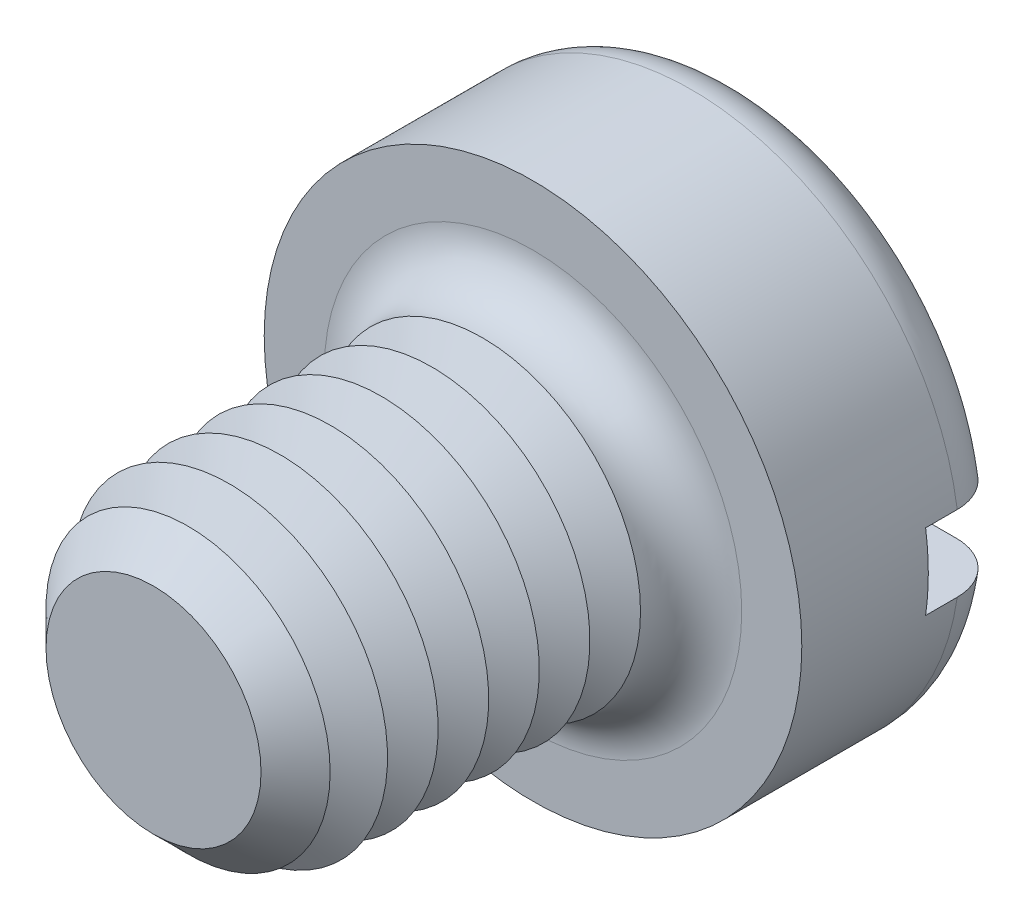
from build123d import *

# Parameters (mm, degrees)
SKETCH3_R           = 4.25
BOSS_EXTRUDE2_DEPTH = 3.3
SKETCH4_R           = 2.5
BOSS_EXTRUDE3_DEPTH = 6
FILLET1_R           = 0.8
CHAMFER1_SIZE       = 0.8
LPATTERN1_COUNT     = 6
LPATTERN1_PITCH     = 0.8
SKETCH8_W           = 8.5
SKETCH8_H           = 1.2
CUT_EXTRUDE1_DEPTH  = 1.3


with BuildPart() as part:
    # Sketch3 → Boss-Extrude2 (new body)
    with BuildSketch(Plane.XY):
        Circle(SKETCH3_R)
    extrude(amount=-BOSS_EXTRUDE2_DEPTH)

    # Sketch4 → Boss-Extrude3 (add)
    with BuildSketch(Plane.XY):
        Circle(SKETCH4_R)
    extrude(amount=BOSS_EXTRUDE3_DEPTH)

    # Fillet1
    fillet1_edges = [part.edges().sort_by_distance(p)[0] for p in [
        (-4.25, 0, -3.3),
        (-2.5, 0, 0),
    ]]
    fillet(fillet1_edges, radius=FILLET1_R)

    # Chamfer1
    chamfer1_edges = [part.edges().sort_by_distance(p)[0] for p in [
        (-2.5, 0, 6),
    ]]
    chamfer(chamfer1_edges, length=CHAMFER1_SIZE)

    # Sketch6 → Cut-Revolve1 (revolve, cut)
    with BuildSketch(Plane(origin=(0, 0, 0), x_dir=(0, 0, -1), z_dir=(1, 0, 0)), mode=Mode.PRIVATE) as cut_revolve1_sk:
        Polygon((-0.8, 2.5), (-1.2, 1.807179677), (-1.6, 2.5), align=None)
    cut_revolve1 = revolve(cut_revolve1_sk.sketch.rotate(Axis((0, 0, -1.694361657), (0, 0, 1)), 90), axis=Axis((0, 0, -1.694361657), (0, 0, 1)), mode=Mode.SUBTRACT)

    # LPattern1: Cut-Revolve1 ×6
    with Locations(*[(0, 0, i * LPATTERN1_PITCH) for i in range(1, LPATTERN1_COUNT)]):
        add(cut_revolve1, mode=Mode.SUBTRACT)

    # Sketch8 → Cut-Extrude1 (cut)
    with BuildSketch(Plane(origin=(0, 0, -3.3), x_dir=(-1, 0, 0), z_dir=(0, 0, -1))):
        Rectangle(SKETCH8_W, SKETCH8_H)
    extrude(amount=-CUT_EXTRUDE1_DEPTH, mode=Mode.SUBTRACT)


solid = part.part
